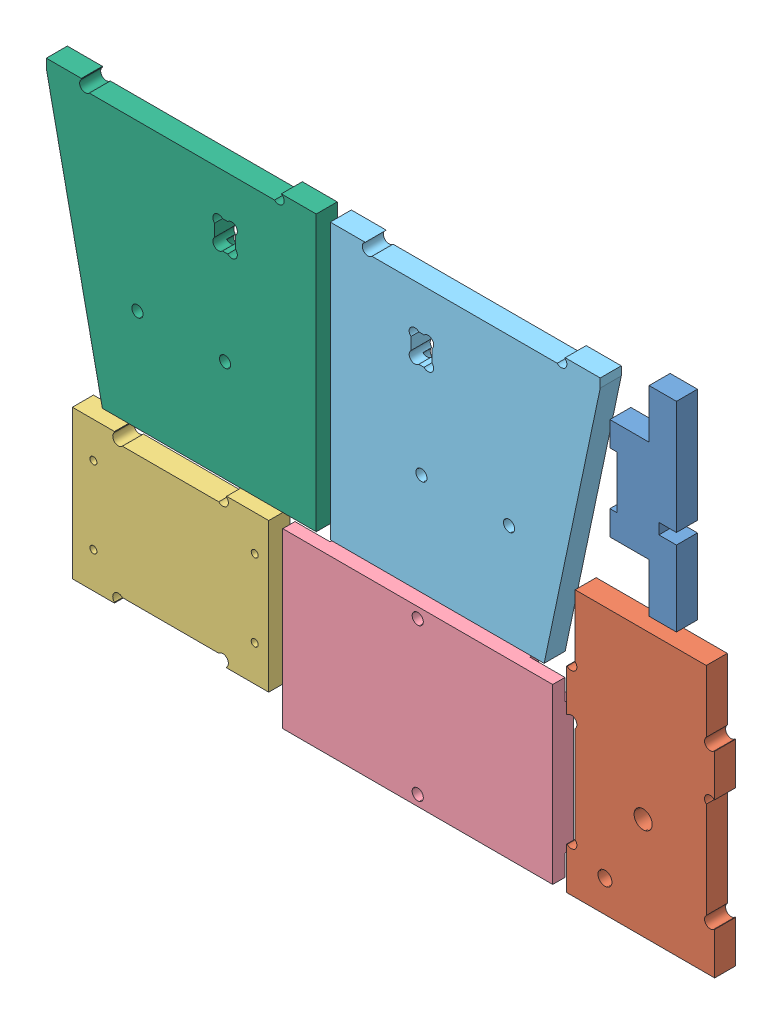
SolidWorks assembly K-BORIR-Panoplie usinage.SLDASM, configuration Défaut (file format 7000). Lengths in mm.
Overall size (223.12 145.99 6).
6 component instances, 6 part files, 21 mates.
Components (placement in the parent):
- K-BORIR-tirette-1: K-BORIR-tirette.SLDPRT [Défaut] at (173.3604 86.6183 54) x (0 1 0) z (0 0 1) size (57 19 6)
- K-BORIR-face2-1: K-BORIR-face2.SLDPRT [Défaut] at (163.1656 14.1183 54) size (42.2 76 6)
- K-BORIR-face1-1: K-BORIR-face1.SLDPRT [Défaut] at (30.0656 13.3183 54) x (0 -1 0) z (0 0 1) size (42.4 56 6)
- K-BORIR-face superieure-1: K-BORIR-face superieure.SLDPRT [Défaut] at (99.5656 9.8183 54) size (77 49.4 6)
- K-BORIR-cote2-1: K-BORIR-cote2.SLDPRT [Défaut] at (105.62 40.5183 60) size (157.06 145.56 6)
- K-BORIR-cote1-1: K-BORIR-cote1.SLDPRT [Défaut] at (39.62 40.5183 54) x (-1 0 0) z (0 0 -1) size (157.06 145.56 6)
Mates (geometry in assembly coordinates):
- Coïncidente1: coincident aligned: plane of K-BORIR-cote2-1 through (85.3615 115.6183 60) normal (0 0 1); plane of K-BORIR-cote1-1 through (59.8786 115.6183 60) normal (0 0 1)
- Coïncidente2: coincident aligned: plane of K-BORIR-face superieure-1 through (69.9656 29.6183 60) normal (0 0 1); plane of K-BORIR-cote2-1 through (85.3615 115.6183 60) normal (0 0 1)
- Coïncidente3: coincident aligned: plane of K-BORIR-face1-1 through (43.9656 33.1183 60) normal (0 0 1); plane of K-BORIR-cote2-1 through (85.3615 115.6183 60) normal (0 0 1)
- Coïncidente4: coincident aligned: plane of K-BORIR-tirette-1 through (173.3604 86.6183 60) normal (0 0 1); plane of K-BORIR-cote2-1 through (85.3615 115.6183 60) normal (0 0 1)
- Coïncidente5: coincident aligned: plane of K-BORIR-face2-1 through (143.3656 28.0183 60) normal (0 0 1); plane of K-BORIR-cote2-1 through (85.3615 115.6183 60) normal (0 0 1)
- Coïncidente6: coincident aligned: plane of K-BORIR-face superieure-1 through (69.9656 29.6183 60) normal (0 0 1); plane of K-BORIR-cote2-1 through (85.3615 115.6183 60) normal (0 0 1)
- Parallèle1: parallel aligned: line of K-BORIR-cote2-1 through (74.62 117.0183 54) axis (0 -1 0); line of K-BORIR-cote1-1 through (70.62 117.0183 54) axis (0 -1 0)
- Parallèle4: parallel aligned: line of K-BORIR-face2-1 through (144.4656 26.8564 54) axis (0 -1 0); line of K-BORIR-cote2-1 through (74.62 117.0183 54) axis (0 -1 0)
- Parallèle5: parallel aligned: line of K-BORIR-face superieure-1 through (61.0656 28.5183 54) axis (0 -1 0); line of K-BORIR-cote2-1 through (74.62 117.0183 54) axis (0 -1 0)
- Parallèle6: parallel anti-aligned: line of K-BORIR-face1-1 through (57.0656 -7.8817 54) axis (0 1 0); line of K-BORIR-cote2-1 through (74.62 117.0183 54) axis (0 -1 0)
- Coïncidente7: coincident anti-aligned: line of K-BORIR-cote2-1 through (74.62 38.5183 54) axis (1 0 0); line of K-BORIR-cote1-1 through (70.62 38.5183 54) axis (-1 0 0)
- Coïncidente8: coincident aligned: line of K-BORIR-face1-1 through (57.0656 34.5183 54) axis (-1 0 0); line of K-BORIR-face superieure-1 through (128.0656 34.5183 54) axis (-1 0 0)
- Coïncidente9: coincident aligned: line of K-BORIR-face2-1 through (142.0656 -14.8817 54) axis (1 0 0); line of K-BORIR-face superieure-1 through (71.0656 -14.8817 54) axis (1 0 0)
- Distance1: distance = 4 mm: line of K-BORIR-cote2-1 through (74.62 38.5183 54) axis (1 0 0); line of K-BORIR-face superieure-1 through (128.0656 34.5183 54) axis (-1 0 0)
- Distance2: distance = 4 mm: line of K-BORIR-cote1-1 through (70.62 117.0183 54) axis (0 -1 0); line of K-BORIR-cote2-1 through (74.62 117.0183 54) axis (0 -1 0)
- Distance3: distance = 4 mm: line of K-BORIR-face1-1 through (57.0656 -7.8817 54) axis (0 1 0); line of K-BORIR-face superieure-1 through (61.0656 28.5183 54) axis (0 -1 0)
- Distance4: distance = 4 mm: point of K-BORIR-face2-1; line of K-BORIR-cote2-1 through (135.62 38.5183 54) axis (0.20601 0.97855 0)
- Distance5: distance = 4 mm: line of K-BORIR-face2-1 through (142.0656 -2.8817 54) axis (0 -1 0); line of K-BORIR-face superieure-1 through (138.0656 -8.8817 54) axis (0 1 0)
- Parallèle8: parallel anti-aligned: line of K-BORIR-tirette-1 through (156.3604 86.1183 54) axis (0 1 0); line of K-BORIR-cote2-1 through (74.62 117.0183 54) axis (0 -1 0)
- Distance6: distance = 4 mm: line of K-BORIR-cote2-1 through (135.62 38.5183 54) axis (0.20601 0.97855 0); point of K-BORIR-tirette-1
- Distance7: distance = 4 mm: line of K-BORIR-tirette-1 through (165.5604 65.1183 54) axis (1 0 0); line of K-BORIR-face2-1 through (181.8656 61.1183 54) axis (-1 0 0)
